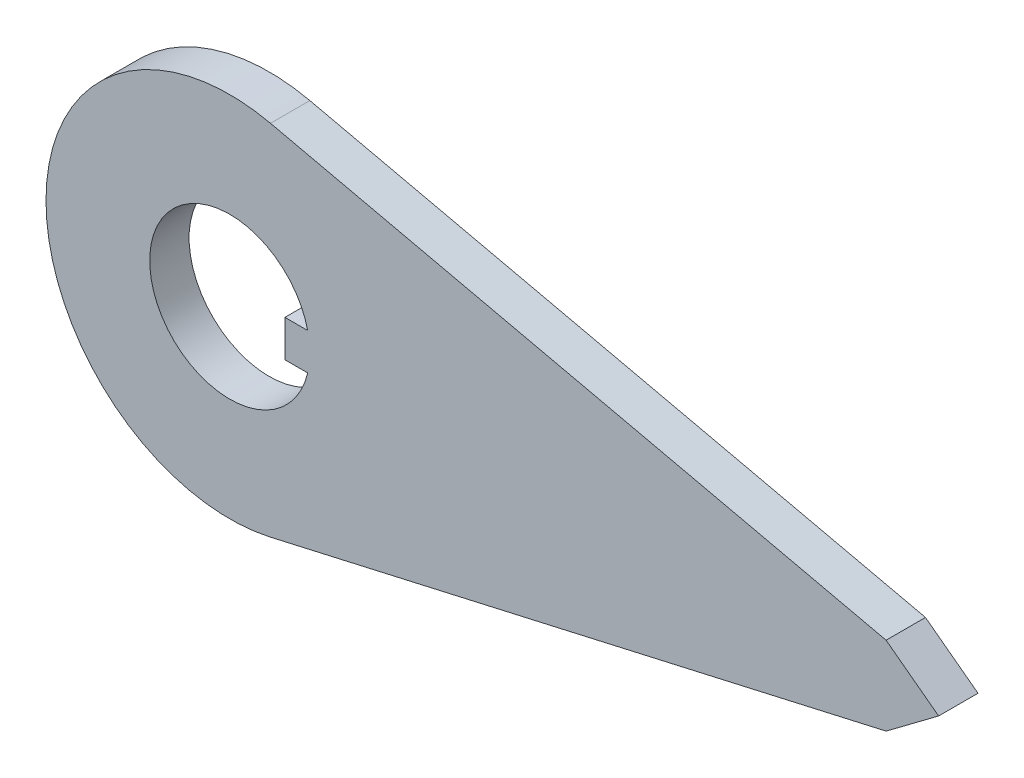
ISO-10303-21;
HEADER;
FILE_DESCRIPTION(('STEP AP214'),'2;1');
FILE_NAME('part.step','',(''),(''),'','','');
FILE_SCHEMA(('AUTOMOTIVE_DESIGN { 1 0 10303 214 1 1 1 1 }'));
ENDSEC;
DATA;
#1=APPLICATION_CONTEXT('core data for automotive mechanical design processes');
#2=APPLICATION_PROTOCOL_DEFINITION('international standard','automotive_design',2000,#1);
#3=PRODUCT_CONTEXT('',#1,'mechanical');
#4=PRODUCT('Part','Part','',(#3));
#5=PRODUCT_RELATED_PRODUCT_CATEGORY('part','',(#4));
#6=PRODUCT_DEFINITION_FORMATION('','',#4);
#7=PRODUCT_DEFINITION_CONTEXT('part definition',#1,'design');
#8=PRODUCT_DEFINITION('design','',#6,#7);
#9=PRODUCT_DEFINITION_SHAPE('','',#8);
#10=(LENGTH_UNIT() NAMED_UNIT(*) SI_UNIT(.MILLI.,.METRE.));
#11=(NAMED_UNIT(*) PLANE_ANGLE_UNIT() SI_UNIT($,.RADIAN.));
#12=(NAMED_UNIT(*) SI_UNIT($,.STERADIAN.) SOLID_ANGLE_UNIT());
#13=UNCERTAINTY_MEASURE_WITH_UNIT(LENGTH_MEASURE(1.E-05),#10,'distance_accuracy_value','');
#14=(GEOMETRIC_REPRESENTATION_CONTEXT(3) GLOBAL_UNCERTAINTY_ASSIGNED_CONTEXT((#13)) GLOBAL_UNIT_ASSIGNED_CONTEXT((#10,
#11,#12)) REPRESENTATION_CONTEXT('',''));
#15=CARTESIAN_POINT('',(0.,0.,0.));
#16=DIRECTION('',(0.,0.,1.));
#17=DIRECTION('',(1.,0.,0.));
#18=AXIS2_PLACEMENT_3D('',#15,#16,#17);
#19=CARTESIAN_POINT('',(0.,0.,3.));
#20=DIRECTION('',(0.,0.,-1.));
#21=DIRECTION('',(-1.,0.,0.));
#22=AXIS2_PLACEMENT_3D('',#19,#20,#21);
#23=CYLINDRICAL_SURFACE('',#22,6.1);
#24=CARTESIAN_POINT('',(0.,0.,0.));
#25=DIRECTION('',(0.,0.,-1.));
#26=DIRECTION('',(1.,0.,0.));
#27=AXIS2_PLACEMENT_3D('',#24,#25,#26);
#28=CIRCLE('',#27,6.1);
#29=CARTESIAN_POINT('',(5.93717104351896,-1.4,0.));
#30=VERTEX_POINT('',#29);
#31=CARTESIAN_POINT('',(5.93717104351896,1.4,0.));
#32=VERTEX_POINT('',#31);
#33=EDGE_CURVE('E119',#30,#32,#28,.T.);
#34=ORIENTED_EDGE('',*,*,#33,.T.);
#35=DIRECTION('',(0.,0.,-1.));
#36=VECTOR('',#35,1.);
#37=CARTESIAN_POINT('',(5.93717104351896,1.4,3.));
#38=LINE('',#37,#36);
#39=CARTESIAN_POINT('',(5.93717104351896,1.4,3.));
#40=VERTEX_POINT('',#39);
#41=EDGE_CURVE('E9',#40,#32,#38,.T.);
#42=ORIENTED_EDGE('',*,*,#41,.F.);
#43=CARTESIAN_POINT('',(0.,0.,3.));
#44=DIRECTION('',(0.,0.,-1.));
#45=DIRECTION('',(1.,0.,0.));
#46=AXIS2_PLACEMENT_3D('',#43,#44,#45);
#47=CIRCLE('',#46,6.1);
#48=CARTESIAN_POINT('',(5.93717104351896,-1.4,3.));
#49=VERTEX_POINT('',#48);
#50=EDGE_CURVE('E140',#49,#40,#47,.T.);
#51=ORIENTED_EDGE('',*,*,#50,.F.);
#52=DIRECTION('',(0.,0.,-1.));
#53=VECTOR('',#52,1.);
#54=CARTESIAN_POINT('',(5.93717104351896,-1.4,3.));
#55=LINE('',#54,#53);
#56=EDGE_CURVE('E106',#49,#30,#55,.T.);
#57=ORIENTED_EDGE('',*,*,#56,.T.);
#58=EDGE_LOOP('',(#34,#42,#51,#57));
#59=FACE_BOUND('',#58,.T.);
#60=ADVANCED_FACE('F14',(#59),#23,.F.);
#61=CARTESIAN_POINT('',(4.2,1.4,3.));
#62=DIRECTION('',(0.,-1.,0.));
#63=DIRECTION('',(0.,0.,-1.));
#64=AXIS2_PLACEMENT_3D('',#61,#62,#63);
#65=PLANE('',#64);
#66=DIRECTION('',(-1.,0.,0.));
#67=VECTOR('',#66,1.);
#68=CARTESIAN_POINT('',(4.2,1.4,0.));
#69=LINE('',#68,#67);
#70=CARTESIAN_POINT('',(4.2,1.4,0.));
#71=VERTEX_POINT('',#70);
#72=EDGE_CURVE('E129',#32,#71,#69,.T.);
#73=ORIENTED_EDGE('',*,*,#72,.T.);
#74=DIRECTION('',(0.,0.,-1.));
#75=VECTOR('',#74,1.);
#76=CARTESIAN_POINT('',(4.2,1.4,3.));
#77=LINE('',#76,#75);
#78=CARTESIAN_POINT('',(4.2,1.4,3.));
#79=VERTEX_POINT('',#78);
#80=EDGE_CURVE('E23',#79,#71,#77,.T.);
#81=ORIENTED_EDGE('',*,*,#80,.F.);
#82=DIRECTION('',(-1.,0.,0.));
#83=VECTOR('',#82,1.);
#84=CARTESIAN_POINT('',(4.2,1.4,3.));
#85=LINE('',#84,#83);
#86=EDGE_CURVE('E31',#40,#79,#85,.T.);
#87=ORIENTED_EDGE('',*,*,#86,.F.);
#88=ORIENTED_EDGE('',*,*,#41,.T.);
#89=EDGE_LOOP('',(#73,#81,#87,#88));
#90=FACE_BOUND('',#89,.T.);
#91=ADVANCED_FACE('F195',(#90),#65,.F.);
#92=CARTESIAN_POINT('',(4.2,1.4,3.));
#93=DIRECTION('',(1.,0.,0.));
#94=DIRECTION('',(0.,0.,-1.));
#95=AXIS2_PLACEMENT_3D('',#92,#93,#94);
#96=PLANE('',#95);
#97=DIRECTION('',(0.,-1.,0.));
#98=VECTOR('',#97,1.);
#99=CARTESIAN_POINT('',(4.2,1.4,0.));
#100=LINE('',#99,#98);
#101=CARTESIAN_POINT('',(4.2,-1.4,0.));
#102=VERTEX_POINT('',#101);
#103=EDGE_CURVE('E126',#71,#102,#100,.T.);
#104=ORIENTED_EDGE('',*,*,#103,.T.);
#105=DIRECTION('',(0.,0.,-1.));
#106=VECTOR('',#105,1.);
#107=CARTESIAN_POINT('',(4.2,-1.4,3.));
#108=LINE('',#107,#106);
#109=CARTESIAN_POINT('',(4.2,-1.4,3.));
#110=VERTEX_POINT('',#109);
#111=EDGE_CURVE('E149',#110,#102,#108,.T.);
#112=ORIENTED_EDGE('',*,*,#111,.F.);
#113=DIRECTION('',(0.,-1.,0.));
#114=VECTOR('',#113,1.);
#115=CARTESIAN_POINT('',(4.2,1.4,3.));
#116=LINE('',#115,#114);
#117=EDGE_CURVE('E36',#79,#110,#116,.T.);
#118=ORIENTED_EDGE('',*,*,#117,.F.);
#119=ORIENTED_EDGE('',*,*,#80,.T.);
#120=EDGE_LOOP('',(#104,#112,#118,#119));
#121=FACE_BOUND('',#120,.T.);
#122=ADVANCED_FACE('F201',(#121),#96,.F.);
#123=CARTESIAN_POINT('',(54.,0.,3.));
#124=DIRECTION('',(-0.6,0.8,0.));
#125=DIRECTION('',(-0.8,-0.6,0.));
#126=AXIS2_PLACEMENT_3D('',#123,#124,#125);
#127=PLANE('',#126);
#128=DIRECTION('',(0.8,0.6,0.));
#129=VECTOR('',#128,1.);
#130=CARTESIAN_POINT('',(54.,0.,0.));
#131=LINE('',#130,#129);
#132=CARTESIAN_POINT('',(50.,-3.,0.));
#133=VERTEX_POINT('',#132);
#134=CARTESIAN_POINT('',(54.,0.,0.));
#135=VERTEX_POINT('',#134);
#136=EDGE_CURVE('E92',#133,#135,#131,.T.);
#137=ORIENTED_EDGE('',*,*,#136,.T.);
#138=DIRECTION('',(0.,0.,-1.));
#139=VECTOR('',#138,1.);
#140=CARTESIAN_POINT('',(54.,0.,3.));
#141=LINE('',#140,#139);
#142=CARTESIAN_POINT('',(54.,0.,3.));
#143=VERTEX_POINT('',#142);
#144=EDGE_CURVE('E18',#143,#135,#141,.T.);
#145=ORIENTED_EDGE('',*,*,#144,.F.);
#146=DIRECTION('',(0.8,0.6,0.));
#147=VECTOR('',#146,1.);
#148=CARTESIAN_POINT('',(54.,0.,3.));
#149=LINE('',#148,#147);
#150=CARTESIAN_POINT('',(50.,-3.,3.));
#151=VERTEX_POINT('',#150);
#152=EDGE_CURVE('E132',#151,#143,#149,.T.);
#153=ORIENTED_EDGE('',*,*,#152,.F.);
#154=DIRECTION('',(0.,0.,-1.));
#155=VECTOR('',#154,1.);
#156=CARTESIAN_POINT('',(50.,-3.,3.));
#157=LINE('',#156,#155);
#158=EDGE_CURVE('E110',#151,#133,#157,.T.);
#159=ORIENTED_EDGE('',*,*,#158,.T.);
#160=EDGE_LOOP('',(#137,#145,#153,#159));
#161=FACE_BOUND('',#160,.T.);
#162=ADVANCED_FACE('F16',(#161),#127,.F.);
#163=CARTESIAN_POINT('',(54.,0.,3.));
#164=DIRECTION('',(-0.6,-0.8,0.));
#165=DIRECTION('',(0.8,-0.6,0.));
#166=AXIS2_PLACEMENT_3D('',#163,#164,#165);
#167=PLANE('',#166);
#168=DIRECTION('',(-0.8,0.6,0.));
#169=VECTOR('',#168,1.);
#170=CARTESIAN_POINT('',(54.,0.,0.));
#171=LINE('',#170,#169);
#172=CARTESIAN_POINT('',(50.,3.,0.));
#173=VERTEX_POINT('',#172);
#174=EDGE_CURVE('E86',#135,#173,#171,.T.);
#175=ORIENTED_EDGE('',*,*,#174,.T.);
#176=DIRECTION('',(0.,0.,-1.));
#177=VECTOR('',#176,1.);
#178=CARTESIAN_POINT('',(50.,3.,3.));
#179=LINE('',#178,#177);
#180=CARTESIAN_POINT('',(50.,3.,3.));
#181=VERTEX_POINT('',#180);
#182=EDGE_CURVE('E107',#181,#173,#179,.T.);
#183=ORIENTED_EDGE('',*,*,#182,.F.);
#184=DIRECTION('',(-0.8,0.6,0.));
#185=VECTOR('',#184,1.);
#186=CARTESIAN_POINT('',(54.,0.,3.));
#187=LINE('',#186,#185);
#188=EDGE_CURVE('E102',#143,#181,#187,.T.);
#189=ORIENTED_EDGE('',*,*,#188,.F.);
#190=ORIENTED_EDGE('',*,*,#144,.T.);
#191=EDGE_LOOP('',(#175,#183,#189,#190));
#192=FACE_BOUND('',#191,.T.);
#193=ADVANCED_FACE('F101',(#192),#167,.F.);
#194=CARTESIAN_POINT('',(50.,3.,3.));
#195=DIRECTION('',(-0.221490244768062,-0.975162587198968,0.));
#196=DIRECTION('',(0.975162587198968,-0.221490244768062,0.));
#197=AXIS2_PLACEMENT_3D('',#194,#195,#196);
#198=PLANE('',#197);
#199=DIRECTION('',(-0.975162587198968,0.221490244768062,0.));
#200=VECTOR('',#199,1.);
#201=CARTESIAN_POINT('',(50.,3.,0.));
#202=LINE('',#201,#200);
#203=CARTESIAN_POINT('',(3.10086342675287,13.6522762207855,0.));
#204=VERTEX_POINT('',#203);
#205=EDGE_CURVE('E94',#173,#204,#202,.T.);
#206=ORIENTED_EDGE('',*,*,#205,.T.);
#207=DIRECTION('',(0.,0.,-1.));
#208=VECTOR('',#207,1.);
#209=CARTESIAN_POINT('',(3.10086342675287,13.6522762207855,3.));
#210=LINE('',#209,#208);
#211=CARTESIAN_POINT('',(3.10086342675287,13.6522762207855,3.));
#212=VERTEX_POINT('',#211);
#213=EDGE_CURVE('E158',#212,#204,#210,.T.);
#214=ORIENTED_EDGE('',*,*,#213,.F.);
#215=DIRECTION('',(-0.975162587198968,0.221490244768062,0.));
#216=VECTOR('',#215,1.);
#217=CARTESIAN_POINT('',(50.,3.,3.));
#218=LINE('',#217,#216);
#219=EDGE_CURVE('E134',#181,#212,#218,.T.);
#220=ORIENTED_EDGE('',*,*,#219,.F.);
#221=ORIENTED_EDGE('',*,*,#182,.T.);
#222=EDGE_LOOP('',(#206,#214,#220,#221));
#223=FACE_BOUND('',#222,.T.);
#224=ADVANCED_FACE('F162',(#223),#198,.F.);
#225=CARTESIAN_POINT('',(0.,0.,3.));
#226=DIRECTION('',(0.,0.,-1.));
#227=DIRECTION('',(-1.,0.,0.));
#228=AXIS2_PLACEMENT_3D('',#225,#226,#227);
#229=CYLINDRICAL_SURFACE('',#228,14.);
#230=CARTESIAN_POINT('',(0.,0.,0.));
#231=DIRECTION('',(0.,0.,1.));
#232=DIRECTION('',(1.,0.,0.));
#233=AXIS2_PLACEMENT_3D('',#230,#231,#232);
#234=CIRCLE('',#233,14.);
#235=CARTESIAN_POINT('',(3.10086342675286,-13.6522762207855,0.));
#236=VERTEX_POINT('',#235);
#237=EDGE_CURVE('E172',#204,#236,#234,.T.);
#238=ORIENTED_EDGE('',*,*,#237,.T.);
#239=DIRECTION('',(0.,0.,-1.));
#240=VECTOR('',#239,1.);
#241=CARTESIAN_POINT('',(3.10086342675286,-13.6522762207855,3.));
#242=LINE('',#241,#240);
#243=CARTESIAN_POINT('',(3.10086342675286,-13.6522762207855,3.));
#244=VERTEX_POINT('',#243);
#245=EDGE_CURVE('E155',#244,#236,#242,.T.);
#246=ORIENTED_EDGE('',*,*,#245,.F.);
#247=CARTESIAN_POINT('',(0.,0.,3.));
#248=DIRECTION('',(0.,0.,1.));
#249=DIRECTION('',(1.,0.,0.));
#250=AXIS2_PLACEMENT_3D('',#247,#248,#249);
#251=CIRCLE('',#250,14.);
#252=EDGE_CURVE('E136',#212,#244,#251,.T.);
#253=ORIENTED_EDGE('',*,*,#252,.F.);
#254=ORIENTED_EDGE('',*,*,#213,.T.);
#255=EDGE_LOOP('',(#238,#246,#253,#254));
#256=FACE_BOUND('',#255,.T.);
#257=ADVANCED_FACE('F183',(#256),#229,.T.);
#258=CARTESIAN_POINT('',(50.,-3.,3.));
#259=DIRECTION('',(-0.221490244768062,0.975162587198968,0.));
#260=DIRECTION('',(-0.975162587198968,-0.221490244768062,0.));
#261=AXIS2_PLACEMENT_3D('',#258,#259,#260);
#262=PLANE('',#261);
#263=DIRECTION('',(0.975162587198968,0.221490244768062,0.));
#264=VECTOR('',#263,1.);
#265=CARTESIAN_POINT('',(50.,-3.,0.));
#266=LINE('',#265,#264);
#267=EDGE_CURVE('E117',#236,#133,#266,.T.);
#268=ORIENTED_EDGE('',*,*,#267,.T.);
#269=ORIENTED_EDGE('',*,*,#158,.F.);
#270=DIRECTION('',(0.975162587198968,0.221490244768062,0.));
#271=VECTOR('',#270,1.);
#272=CARTESIAN_POINT('',(50.,-3.,3.));
#273=LINE('',#272,#271);
#274=EDGE_CURVE('E138',#244,#151,#273,.T.);
#275=ORIENTED_EDGE('',*,*,#274,.F.);
#276=ORIENTED_EDGE('',*,*,#245,.T.);
#277=EDGE_LOOP('',(#268,#269,#275,#276));
#278=FACE_BOUND('',#277,.T.);
#279=ADVANCED_FACE('F170',(#278),#262,.F.);
#280=CARTESIAN_POINT('',(4.2,-1.4,3.));
#281=DIRECTION('',(0.,1.,0.));
#282=DIRECTION('',(0.,0.,1.));
#283=AXIS2_PLACEMENT_3D('',#280,#281,#282);
#284=PLANE('',#283);
#285=DIRECTION('',(1.,0.,0.));
#286=VECTOR('',#285,1.);
#287=CARTESIAN_POINT('',(4.2,-1.4,0.));
#288=LINE('',#287,#286);
#289=EDGE_CURVE('E123',#102,#30,#288,.T.);
#290=ORIENTED_EDGE('',*,*,#289,.T.);
#291=ORIENTED_EDGE('',*,*,#56,.F.);
#292=DIRECTION('',(1.,0.,0.));
#293=VECTOR('',#292,1.);
#294=CARTESIAN_POINT('',(4.2,-1.4,3.));
#295=LINE('',#294,#293);
#296=EDGE_CURVE('E143',#110,#49,#295,.T.);
#297=ORIENTED_EDGE('',*,*,#296,.F.);
#298=ORIENTED_EDGE('',*,*,#111,.T.);
#299=EDGE_LOOP('',(#290,#291,#297,#298));
#300=FACE_BOUND('',#299,.T.);
#301=ADVANCED_FACE('F191',(#300),#284,.F.);
#302=CARTESIAN_POINT('',(0.,0.,3.));
#303=DIRECTION('',(0.,0.,1.));
#304=DIRECTION('',(1.,0.,0.));
#305=AXIS2_PLACEMENT_3D('',#302,#303,#304);
#306=PLANE('',#305);
#307=ORIENTED_EDGE('',*,*,#152,.T.);
#308=ORIENTED_EDGE('',*,*,#188,.T.);
#309=ORIENTED_EDGE('',*,*,#219,.T.);
#310=ORIENTED_EDGE('',*,*,#252,.T.);
#311=ORIENTED_EDGE('',*,*,#274,.T.);
#312=EDGE_LOOP('',(#307,#308,#309,#310,#311));
#313=FACE_BOUND('',#312,.T.);
#314=ORIENTED_EDGE('',*,*,#50,.T.);
#315=ORIENTED_EDGE('',*,*,#86,.T.);
#316=ORIENTED_EDGE('',*,*,#117,.T.);
#317=ORIENTED_EDGE('',*,*,#296,.T.);
#318=EDGE_LOOP('',(#314,#315,#316,#317));
#319=FACE_BOUND('',#318,.T.);
#320=ADVANCED_FACE('F166',(#313,#319),#306,.T.);
#321=CARTESIAN_POINT('',(0.,0.,0.));
#322=DIRECTION('',(0.,0.,1.));
#323=DIRECTION('',(1.,0.,0.));
#324=AXIS2_PLACEMENT_3D('',#321,#322,#323);
#325=PLANE('',#324);
#326=ORIENTED_EDGE('',*,*,#136,.F.);
#327=ORIENTED_EDGE('',*,*,#267,.F.);
#328=ORIENTED_EDGE('',*,*,#237,.F.);
#329=ORIENTED_EDGE('',*,*,#205,.F.);
#330=ORIENTED_EDGE('',*,*,#174,.F.);
#331=EDGE_LOOP('',(#326,#327,#328,#329,#330));
#332=FACE_BOUND('',#331,.T.);
#333=ORIENTED_EDGE('',*,*,#33,.F.);
#334=ORIENTED_EDGE('',*,*,#289,.F.);
#335=ORIENTED_EDGE('',*,*,#103,.F.);
#336=ORIENTED_EDGE('',*,*,#72,.F.);
#337=EDGE_LOOP('',(#333,#334,#335,#336));
#338=FACE_BOUND('',#337,.T.);
#339=ADVANCED_FACE('F88',(#332,#338),#325,.F.);
#340=CLOSED_SHELL('',(#60,#91,#122,#162,#193,#224,#257,#279,#301,#320,#339));
#341=MANIFOLD_SOLID_BREP('B1',#340);
#342=ADVANCED_BREP_SHAPE_REPRESENTATION('',(#18,#341),#14);
#343=SHAPE_DEFINITION_REPRESENTATION(#9,#342);
ENDSEC;
END-ISO-10303-21;
